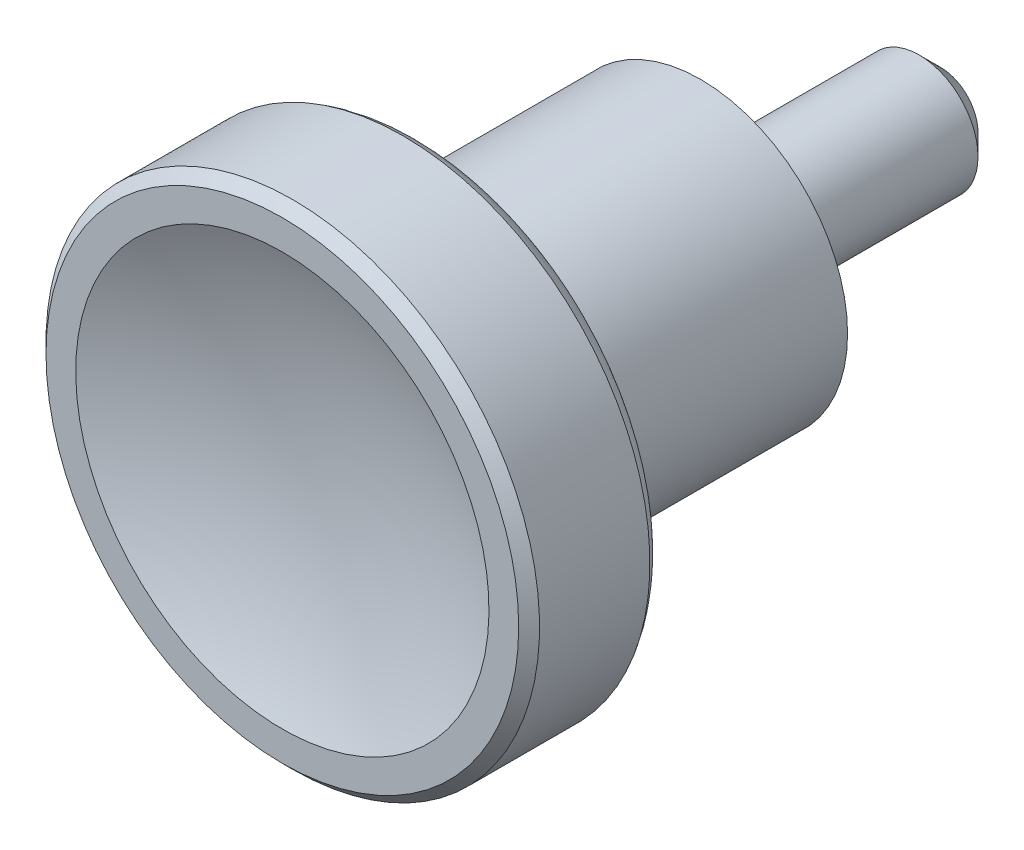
ISO-10303-21;
HEADER;
FILE_DESCRIPTION(('STEP AP214'),'2;1');
FILE_NAME('part.step','',(''),(''),'','','');
FILE_SCHEMA(('AUTOMOTIVE_DESIGN { 1 0 10303 214 1 1 1 1 }'));
ENDSEC;
DATA;
#1=APPLICATION_CONTEXT('core data for automotive mechanical design processes');
#2=APPLICATION_PROTOCOL_DEFINITION('international standard','automotive_design',2000,#1);
#3=PRODUCT_CONTEXT('',#1,'mechanical');
#4=PRODUCT('Part','Part','',(#3));
#5=PRODUCT_RELATED_PRODUCT_CATEGORY('part','',(#4));
#6=PRODUCT_DEFINITION_FORMATION('','',#4);
#7=PRODUCT_DEFINITION_CONTEXT('part definition',#1,'design');
#8=PRODUCT_DEFINITION('design','',#6,#7);
#9=PRODUCT_DEFINITION_SHAPE('','',#8);
#10=(LENGTH_UNIT() NAMED_UNIT(*) SI_UNIT(.MILLI.,.METRE.));
#11=(NAMED_UNIT(*) PLANE_ANGLE_UNIT() SI_UNIT($,.RADIAN.));
#12=(NAMED_UNIT(*) SI_UNIT($,.STERADIAN.) SOLID_ANGLE_UNIT());
#13=UNCERTAINTY_MEASURE_WITH_UNIT(LENGTH_MEASURE(1.E-05),#10,'distance_accuracy_value','');
#14=(GEOMETRIC_REPRESENTATION_CONTEXT(3) GLOBAL_UNCERTAINTY_ASSIGNED_CONTEXT((#13)) GLOBAL_UNIT_ASSIGNED_CONTEXT((#10,
#11,#12)) REPRESENTATION_CONTEXT('',''));
#15=CARTESIAN_POINT('',(0.,0.,0.));
#16=DIRECTION('',(0.,0.,1.));
#17=DIRECTION('',(1.,0.,0.));
#18=AXIS2_PLACEMENT_3D('',#15,#16,#17);
#19=CARTESIAN_POINT('',(4.1645375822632,0.,0.2));
#20=DIRECTION('',(0.,0.,-1.));
#21=DIRECTION('',(0.,1.,0.));
#22=AXIS2_PLACEMENT_3D('',#19,#20,#21);
#23=PLANE('',#22);
#24=CARTESIAN_POINT('',(0.,0.,0.2));
#25=DIRECTION('',(0.,0.,-1.));
#26=DIRECTION('',(0.,1.,0.));
#27=AXIS2_PLACEMENT_3D('',#24,#25,#26);
#28=CIRCLE('',#27,6.25);
#29=CARTESIAN_POINT('',(0.,6.25,0.2));
#30=VERTEX_POINT('',#29);
#31=EDGE_CURVE('E23',#30,#30,#28,.T.);
#32=ORIENTED_EDGE('',*,*,#31,.T.);
#33=EDGE_LOOP('',(#32));
#34=FACE_BOUND('',#33,.T.);
#35=CARTESIAN_POINT('',(0.,0.,0.2));
#36=DIRECTION('',(0.,0.,-1.));
#37=DIRECTION('',(0.,1.,0.));
#38=AXIS2_PLACEMENT_3D('',#35,#36,#37);
#39=CIRCLE('',#38,4.16453758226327);
#40=CARTESIAN_POINT('',(0.,4.16453758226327,0.2));
#41=VERTEX_POINT('',#40);
#42=EDGE_CURVE('E56',#41,#41,#39,.T.);
#43=ORIENTED_EDGE('',*,*,#42,.F.);
#44=EDGE_LOOP('',(#43));
#45=FACE_BOUND('',#44,.T.);
#46=ADVANCED_FACE('F12',(#34,#45),#23,.T.);
#47=CARTESIAN_POINT('',(0.,0.,-4.6630015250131));
#48=DIRECTION('',(0.,0.,-1.));
#49=DIRECTION('',(0.,1.,0.));
#50=AXIS2_PLACEMENT_3D('',#47,#48,#49);
#51=CYLINDRICAL_SURFACE('',#50,6.25);
#52=CARTESIAN_POINT('',(0.,0.,10.5));
#53=DIRECTION('',(0.,0.,-1.));
#54=DIRECTION('',(0.,1.,0.));
#55=AXIS2_PLACEMENT_3D('',#52,#53,#54);
#56=CIRCLE('',#55,6.25);
#57=CARTESIAN_POINT('',(0.,6.25,10.5));
#58=VERTEX_POINT('',#57);
#59=EDGE_CURVE('E27',#58,#58,#56,.T.);
#60=ORIENTED_EDGE('',*,*,#59,.T.);
#61=EDGE_LOOP('',(#60));
#62=FACE_BOUND('',#61,.T.);
#63=ORIENTED_EDGE('',*,*,#31,.F.);
#64=EDGE_LOOP('',(#63));
#65=FACE_BOUND('',#64,.T.);
#66=ADVANCED_FACE('F63',(#62,#65),#51,.T.);
#67=CARTESIAN_POINT('',(0.,0.,10.4930187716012));
#68=DIRECTION('',(0.,0.,-1.));
#69=DIRECTION('',(0.,1.,0.));
#70=AXIS2_PLACEMENT_3D('',#67,#68,#69);
#71=TOROIDAL_SURFACE('',#70,7.04996953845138,0.800000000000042);
#72=ORIENTED_EDGE('',*,*,#59,.F.);
#73=EDGE_LOOP('',(#72));
#74=FACE_BOUND('',#73,.T.);
#75=CARTESIAN_POINT('',(0.,0.,11.2657594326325));
#76=DIRECTION('',(0.,0.,-1.));
#77=DIRECTION('',(0.,1.,0.));
#78=AXIS2_PLACEMENT_3D('',#75,#76,#77);
#79=CIRCLE('',#78,6.84291430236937);
#80=CARTESIAN_POINT('',(0.,6.84291430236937,11.2657594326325));
#81=VERTEX_POINT('',#80);
#82=EDGE_CURVE('E32',#81,#81,#79,.T.);
#83=ORIENTED_EDGE('',*,*,#82,.T.);
#84=EDGE_LOOP('',(#83));
#85=FACE_BOUND('',#84,.T.);
#86=ADVANCED_FACE('F70',(#74,#85),#71,.F.);
#87=CARTESIAN_POINT('',(0.,0.,11.8244404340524));
#88=DIRECTION('',(0.,0.,1.));
#89=DIRECTION('',(0.,-1.,0.));
#90=AXIS2_PLACEMENT_3D('',#87,#88,#89);
#91=CONICAL_SURFACE('',#90,8.92794018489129,1.30899693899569);
#92=ORIENTED_EDGE('',*,*,#82,.F.);
#93=EDGE_LOOP('',(#92));
#94=FACE_BOUND('',#93,.T.);
#95=CARTESIAN_POINT('',(0.,0.,11.8244404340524));
#96=DIRECTION('',(0.,0.,-1.));
#97=DIRECTION('',(0.,1.,0.));
#98=AXIS2_PLACEMENT_3D('',#95,#96,#97);
#99=CIRCLE('',#98,8.92794018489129);
#100=CARTESIAN_POINT('',(0.,8.92794018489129,11.8244404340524));
#101=VERTEX_POINT('',#100);
#102=EDGE_CURVE('E35',#101,#101,#99,.T.);
#103=ORIENTED_EDGE('',*,*,#102,.T.);
#104=EDGE_LOOP('',(#103));
#105=FACE_BOUND('',#104,.T.);
#106=ADVANCED_FACE('F76',(#94,#105),#91,.T.);
#107=CARTESIAN_POINT('',(0.,0.,13.8158755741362));
#108=DIRECTION('',(0.,0.,-1.));
#109=DIRECTION('',(0.,1.,0.));
#110=AXIS2_PLACEMENT_3D('',#107,#108,#109);
#111=TOROIDAL_SURFACE('',#110,8.74304539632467,2.);
#112=CARTESIAN_POINT('',(0.,0.,12.860307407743));
#113=DIRECTION('',(0.,0.,-1.));
#114=DIRECTION('',(0.,1.,0.));
#115=AXIS2_PLACEMENT_3D('',#112,#113,#114);
#116=CIRCLE('',#115,10.5);
#117=CARTESIAN_POINT('',(0.,10.5,12.860307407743));
#118=VERTEX_POINT('',#117);
#119=EDGE_CURVE('E38',#118,#118,#116,.T.);
#120=ORIENTED_EDGE('',*,*,#119,.T.);
#121=EDGE_LOOP('',(#120));
#122=FACE_BOUND('',#121,.T.);
#123=ORIENTED_EDGE('',*,*,#102,.F.);
#124=EDGE_LOOP('',(#123));
#125=FACE_BOUND('',#124,.T.);
#126=ADVANCED_FACE('F80',(#122,#125),#111,.T.);
#127=CARTESIAN_POINT('',(0.,0.,-4.6630015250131));
#128=DIRECTION('',(0.,0.,-1.));
#129=DIRECTION('',(0.,1.,0.));
#130=AXIS2_PLACEMENT_3D('',#127,#128,#129);
#131=CYLINDRICAL_SURFACE('',#130,10.5);
#132=ORIENTED_EDGE('',*,*,#119,.F.);
#133=EDGE_LOOP('',(#132));
#134=FACE_BOUND('',#133,.T.);
#135=CARTESIAN_POINT('',(0.,0.,17.5568228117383));
#136=DIRECTION('',(0.,0.,-1.));
#137=DIRECTION('',(0.,1.,0.));
#138=AXIS2_PLACEMENT_3D('',#135,#136,#137);
#139=CIRCLE('',#138,10.5);
#140=CARTESIAN_POINT('',(0.,10.5,17.5568228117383));
#141=VERTEX_POINT('',#140);
#142=EDGE_CURVE('E41',#141,#141,#139,.T.);
#143=ORIENTED_EDGE('',*,*,#142,.T.);
#144=EDGE_LOOP('',(#143));
#145=FACE_BOUND('',#144,.T.);
#146=ADVANCED_FACE('F84',(#134,#145),#131,.T.);
#147=CARTESIAN_POINT('',(0.,0.,18.));
#148=DIRECTION('',(0.,0.,-1.));
#149=DIRECTION('',(0.,1.,0.));
#150=AXIS2_PLACEMENT_3D('',#147,#148,#149);
#151=CONICAL_SURFACE('',#150,10.0568228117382,0.785398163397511);
#152=ORIENTED_EDGE('',*,*,#142,.F.);
#153=EDGE_LOOP('',(#152));
#154=FACE_BOUND('',#153,.T.);
#155=CARTESIAN_POINT('',(0.,0.,18.));
#156=DIRECTION('',(0.,0.,-1.));
#157=DIRECTION('',(0.,1.,0.));
#158=AXIS2_PLACEMENT_3D('',#155,#156,#157);
#159=CIRCLE('',#158,10.0568228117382);
#160=CARTESIAN_POINT('',(0.,10.0568228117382,18.));
#161=VERTEX_POINT('',#160);
#162=EDGE_CURVE('E44',#161,#161,#159,.T.);
#163=ORIENTED_EDGE('',*,*,#162,.T.);
#164=EDGE_LOOP('',(#163));
#165=FACE_BOUND('',#164,.T.);
#166=ADVANCED_FACE('F88',(#154,#165),#151,.T.);
#167=CARTESIAN_POINT('',(10.0568228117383,0.,18.));
#168=DIRECTION('',(0.,0.,1.));
#169=DIRECTION('',(0.,-1.,0.));
#170=AXIS2_PLACEMENT_3D('',#167,#168,#169);
#171=PLANE('',#170);
#172=CARTESIAN_POINT('',(0.,0.,18.));
#173=DIRECTION('',(0.,0.,-1.));
#174=DIRECTION('',(0.,1.,0.));
#175=AXIS2_PLACEMENT_3D('',#172,#173,#174);
#176=CIRCLE('',#175,8.7922554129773);
#177=CARTESIAN_POINT('',(0.,8.7922554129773,18.));
#178=VERTEX_POINT('',#177);
#179=EDGE_CURVE('E47',#178,#178,#176,.T.);
#180=ORIENTED_EDGE('',*,*,#179,.T.);
#181=EDGE_LOOP('',(#180));
#182=FACE_BOUND('',#181,.T.);
#183=ORIENTED_EDGE('',*,*,#162,.F.);
#184=EDGE_LOOP('',(#183));
#185=FACE_BOUND('',#184,.T.);
#186=ADVANCED_FACE('F92',(#182,#185),#171,.T.);
#187=CARTESIAN_POINT('',(0.,0.,37.5129983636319));
#188=DIRECTION('',(0.,-1.,0.));
#189=DIRECTION('',(1.,0.,0.));
#190=AXIS2_PLACEMENT_3D('',#187,#188,#189);
#191=SPHERICAL_SURFACE('',#190,21.4023564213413);
#192=CARTESIAN_POINT('',(0.,0.,37.5129983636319));
#193=DIRECTION('',(0.,0.,-1.));
#194=DIRECTION('',(0.,1.,0.));
#195=AXIS2_PLACEMENT_3D('',#192,#193,#194);
#196=SPHERICAL_SURFACE('',#195,21.4023564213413);
#197=ORIENTED_EDGE('',*,*,#179,.F.);
#198=EDGE_LOOP('',(#197));
#199=FACE_BOUND('',#198,.T.);
#200=ADVANCED_FACE('F96',(#199),#196,.F.);
#201=CARTESIAN_POINT('',(2.5,0.,-10.));
#202=DIRECTION('',(0.,0.,1.));
#203=DIRECTION('',(0.,-1.,0.));
#204=AXIS2_PLACEMENT_3D('',#201,#202,#203);
#205=PLANE('',#204);
#206=CARTESIAN_POINT('',(0.,0.,-10.));
#207=DIRECTION('',(0.,0.,1.));
#208=DIRECTION('',(1.,0.,0.));
#209=AXIS2_PLACEMENT_3D('',#206,#207,#208);
#210=CIRCLE('',#209,1.6);
#211=CARTESIAN_POINT('',(1.6,0.,-10.));
#212=VERTEX_POINT('',#211);
#213=EDGE_CURVE('E19',#212,#212,#210,.F.);
#214=ORIENTED_EDGE('',*,*,#213,.T.);
#215=EDGE_LOOP('',(#214));
#216=FACE_BOUND('',#215,.T.);
#217=ADVANCED_FACE('F100',(#216),#205,.F.);
#218=CARTESIAN_POINT('',(0.,0.,-4.6630015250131));
#219=DIRECTION('',(0.,0.,-1.));
#220=DIRECTION('',(0.,1.,0.));
#221=AXIS2_PLACEMENT_3D('',#218,#219,#220);
#222=CYLINDRICAL_SURFACE('',#221,2.5);
#223=CARTESIAN_POINT('',(0.,0.,-9.1));
#224=DIRECTION('',(0.,0.,1.));
#225=DIRECTION('',(1.,0.,0.));
#226=AXIS2_PLACEMENT_3D('',#223,#224,#225);
#227=CIRCLE('',#226,2.5);
#228=CARTESIAN_POINT('',(2.5,0.,-9.1));
#229=VERTEX_POINT('',#228);
#230=EDGE_CURVE('E8',#229,#229,#227,.T.);
#231=ORIENTED_EDGE('',*,*,#230,.T.);
#232=EDGE_LOOP('',(#231));
#233=FACE_BOUND('',#232,.T.);
#234=CARTESIAN_POINT('',(0.,0.,0.));
#235=DIRECTION('',(0.,0.,-1.));
#236=DIRECTION('',(0.,1.,0.));
#237=AXIS2_PLACEMENT_3D('',#234,#235,#236);
#238=CIRCLE('',#237,2.5);
#239=CARTESIAN_POINT('',(0.,2.5,0.));
#240=VERTEX_POINT('',#239);
#241=EDGE_CURVE('E50',#240,#240,#238,.T.);
#242=ORIENTED_EDGE('',*,*,#241,.T.);
#243=EDGE_LOOP('',(#242));
#244=FACE_BOUND('',#243,.T.);
#245=ADVANCED_FACE('F104',(#233,#244),#222,.T.);
#246=CARTESIAN_POINT('',(2.5,0.,0.));
#247=DIRECTION('',(0.,0.,-1.));
#248=DIRECTION('',(0.,1.,0.));
#249=AXIS2_PLACEMENT_3D('',#246,#247,#248);
#250=PLANE('',#249);
#251=CARTESIAN_POINT('',(0.,0.,0.));
#252=DIRECTION('',(0.,0.,-1.));
#253=DIRECTION('',(0.,1.,0.));
#254=AXIS2_PLACEMENT_3D('',#251,#252,#253);
#255=CIRCLE('',#254,4.);
#256=CARTESIAN_POINT('',(0.,4.,0.));
#257=VERTEX_POINT('',#256);
#258=EDGE_CURVE('E53',#257,#257,#255,.T.);
#259=ORIENTED_EDGE('',*,*,#258,.T.);
#260=EDGE_LOOP('',(#259));
#261=FACE_BOUND('',#260,.T.);
#262=ORIENTED_EDGE('',*,*,#241,.F.);
#263=EDGE_LOOP('',(#262));
#264=FACE_BOUND('',#263,.T.);
#265=ADVANCED_FACE('F107',(#261,#264),#250,.T.);
#266=CARTESIAN_POINT('',(0.,0.,0.2));
#267=DIRECTION('',(0.,0.,1.));
#268=DIRECTION('',(0.,-1.,0.));
#269=AXIS2_PLACEMENT_3D('',#266,#267,#268);
#270=CONICAL_SURFACE('',#269,4.16453758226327,0.688422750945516);
#271=ORIENTED_EDGE('',*,*,#258,.F.);
#272=EDGE_LOOP('',(#271));
#273=FACE_BOUND('',#272,.T.);
#274=ORIENTED_EDGE('',*,*,#42,.T.);
#275=EDGE_LOOP('',(#274));
#276=FACE_BOUND('',#275,.T.);
#277=ADVANCED_FACE('F60',(#273,#276),#270,.T.);
#278=CARTESIAN_POINT('',(0.,0.,-10.));
#279=DIRECTION('',(0.,0.,1.));
#280=DIRECTION('',(1.,0.,0.));
#281=AXIS2_PLACEMENT_3D('',#278,#279,#280);
#282=CONICAL_SURFACE('',#281,1.6,0.785398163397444);
#283=ORIENTED_EDGE('',*,*,#230,.F.);
#284=EDGE_LOOP('',(#283));
#285=FACE_BOUND('',#284,.T.);
#286=ORIENTED_EDGE('',*,*,#213,.F.);
#287=EDGE_LOOP('',(#286));
#288=FACE_BOUND('',#287,.T.);
#289=ADVANCED_FACE('F14',(#285,#288),#282,.T.);
#290=CLOSED_SHELL('',(#46,#66,#86,#106,#126,#146,#166,#186,#200,#217,#245,#265,#277,#289));
#291=MANIFOLD_SOLID_BREP('B1',#290);
#292=ADVANCED_BREP_SHAPE_REPRESENTATION('',(#18,#291),#14);
#293=SHAPE_DEFINITION_REPRESENTATION(#9,#292);
ENDSEC;
END-ISO-10303-21;
